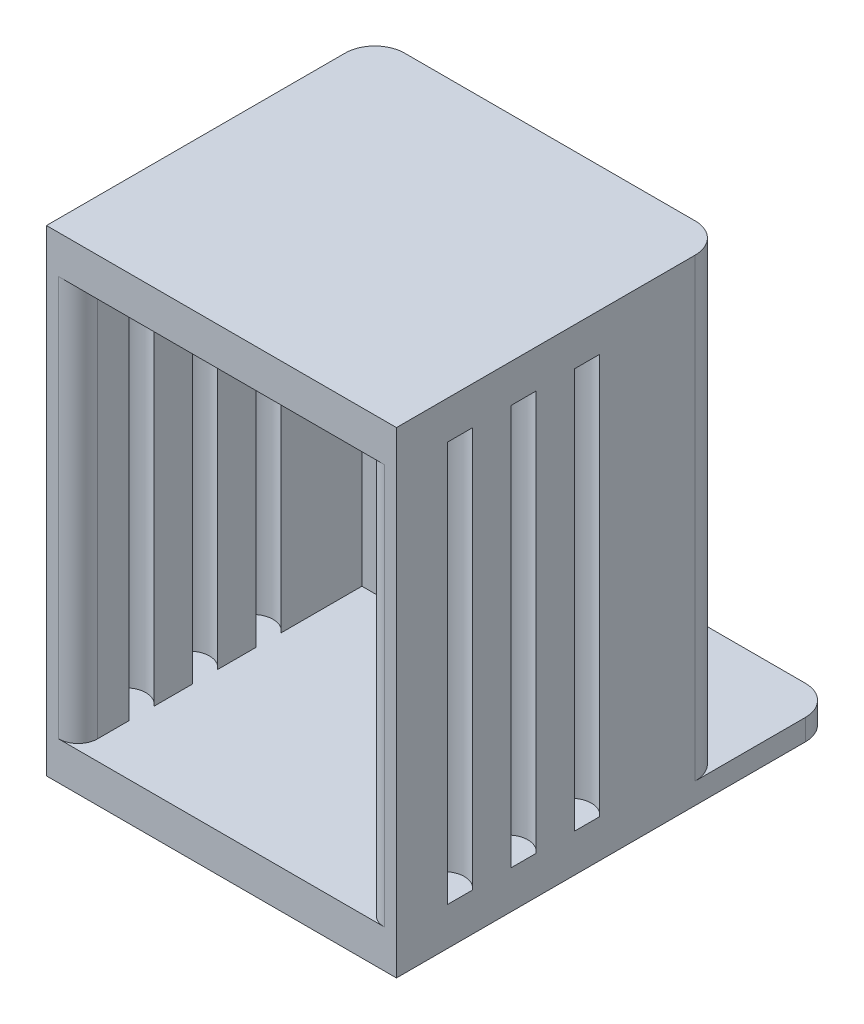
ISO-10303-21;
HEADER;
FILE_DESCRIPTION(('STEP AP214'),'2;1');
FILE_NAME('part.step','',(''),(''),'','','');
FILE_SCHEMA(('AUTOMOTIVE_DESIGN { 1 0 10303 214 1 1 1 1 }'));
ENDSEC;
DATA;
#1=APPLICATION_CONTEXT('core data for automotive mechanical design processes');
#2=APPLICATION_PROTOCOL_DEFINITION('international standard','automotive_design',2000,#1);
#3=PRODUCT_CONTEXT('',#1,'mechanical');
#4=PRODUCT('Part','Part','',(#3));
#5=PRODUCT_RELATED_PRODUCT_CATEGORY('part','',(#4));
#6=PRODUCT_DEFINITION_FORMATION('','',#4);
#7=PRODUCT_DEFINITION_CONTEXT('part definition',#1,'design');
#8=PRODUCT_DEFINITION('design','',#6,#7);
#9=PRODUCT_DEFINITION_SHAPE('','',#8);
#10=(LENGTH_UNIT() NAMED_UNIT(*) SI_UNIT(.MILLI.,.METRE.));
#11=(NAMED_UNIT(*) PLANE_ANGLE_UNIT() SI_UNIT($,.RADIAN.));
#12=(NAMED_UNIT(*) SI_UNIT($,.STERADIAN.) SOLID_ANGLE_UNIT());
#13=UNCERTAINTY_MEASURE_WITH_UNIT(LENGTH_MEASURE(1.E-05),#10,'distance_accuracy_value','');
#14=(GEOMETRIC_REPRESENTATION_CONTEXT(3) GLOBAL_UNCERTAINTY_ASSIGNED_CONTEXT((#13)) GLOBAL_UNIT_ASSIGNED_CONTEXT((#10,
#11,#12)) REPRESENTATION_CONTEXT('',''));
#15=CARTESIAN_POINT('',(0.,0.,0.));
#16=DIRECTION('',(0.,0.,1.));
#17=DIRECTION('',(1.,0.,0.));
#18=AXIS2_PLACEMENT_3D('',#15,#16,#17);
#19=CARTESIAN_POINT('',(-10.4902,28.575,0.));
#20=DIRECTION('',(1.,0.,0.));
#21=DIRECTION('',(0.,0.,-1.));
#22=AXIS2_PLACEMENT_3D('',#19,#20,#21);
#23=PLANE('',#22);
#24=DIRECTION('',(0.,0.,1.));
#25=VECTOR('',#24,1.);
#26=CARTESIAN_POINT('',(-10.4902,2.286,0.));
#27=LINE('',#26,#25);
#28=CARTESIAN_POINT('',(-10.4902,2.286,-8.36862702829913));
#29=VERTEX_POINT('',#28);
#30=CARTESIAN_POINT('',(-10.4902,2.286,-6.87137297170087));
#31=VERTEX_POINT('',#30);
#32=EDGE_CURVE('E339',#29,#31,#27,.T.);
#33=ORIENTED_EDGE('',*,*,#32,.F.);
#34=DIRECTION('',(0.,1.,0.));
#35=VECTOR('',#34,1.);
#36=CARTESIAN_POINT('',(-10.4902,2.286,-8.36862702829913));
#37=LINE('',#36,#35);
#38=CARTESIAN_POINT('',(-10.4902,26.289,-8.36862702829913));
#39=VERTEX_POINT('',#38);
#40=EDGE_CURVE('E334',#39,#29,#37,.F.);
#41=ORIENTED_EDGE('',*,*,#40,.F.);
#42=DIRECTION('',(0.,0.,1.));
#43=VECTOR('',#42,1.);
#44=CARTESIAN_POINT('',(-10.4902,26.289,0.));
#45=LINE('',#44,#43);
#46=CARTESIAN_POINT('',(-10.4902,26.289,-6.87137297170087));
#47=VERTEX_POINT('',#46);
#48=EDGE_CURVE('E336',#39,#47,#45,.T.);
#49=ORIENTED_EDGE('',*,*,#48,.T.);
#50=DIRECTION('',(0.,1.,0.));
#51=VECTOR('',#50,1.);
#52=CARTESIAN_POINT('',(-10.4902,2.286,-6.87137297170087));
#53=LINE('',#52,#51);
#54=EDGE_CURVE('E331',#31,#47,#53,.T.);
#55=ORIENTED_EDGE('',*,*,#54,.F.);
#56=EDGE_LOOP('',(#33,#41,#49,#55));
#57=FACE_BOUND('',#56,.T.);
#58=DIRECTION('',(0.,0.,-1.));
#59=VECTOR('',#58,1.);
#60=CARTESIAN_POINT('',(-10.4902,1.27,-26.289));
#61=LINE('',#60,#59);
#62=CARTESIAN_POINT('',(-10.4902,1.27,-17.907));
#63=VERTEX_POINT('',#62);
#64=CARTESIAN_POINT('',(-10.4902,1.27,-24.511));
#65=VERTEX_POINT('',#64);
#66=EDGE_CURVE('E443',#63,#65,#61,.T.);
#67=ORIENTED_EDGE('',*,*,#66,.T.);
#68=DIRECTION('',(0.,-1.,0.));
#69=VECTOR('',#68,1.);
#70=CARTESIAN_POINT('',(-10.4902,0.,-24.511));
#71=LINE('',#70,#69);
#72=CARTESIAN_POINT('',(-10.4902,0.,-24.511));
#73=VERTEX_POINT('',#72);
#74=EDGE_CURVE('E471',#65,#73,#71,.T.);
#75=ORIENTED_EDGE('',*,*,#74,.T.);
#76=DIRECTION('',(0.,0.,1.));
#77=VECTOR('',#76,1.);
#78=CARTESIAN_POINT('',(-10.4902,0.,0.));
#79=LINE('',#78,#77);
#80=CARTESIAN_POINT('',(-10.4902,0.,0.));
#81=VERTEX_POINT('',#80);
#82=EDGE_CURVE('E505',#73,#81,#79,.T.);
#83=ORIENTED_EDGE('',*,*,#82,.T.);
#84=DIRECTION('',(0.,-1.,0.));
#85=VECTOR('',#84,1.);
#86=CARTESIAN_POINT('',(-10.4902,28.575,0.));
#87=LINE('',#86,#85);
#88=CARTESIAN_POINT('',(-10.4902,28.575,0.));
#89=VERTEX_POINT('',#88);
#90=EDGE_CURVE('E492',#89,#81,#87,.T.);
#91=ORIENTED_EDGE('',*,*,#90,.F.);
#92=DIRECTION('',(0.,0.,1.));
#93=VECTOR('',#92,1.);
#94=CARTESIAN_POINT('',(-10.4902,28.575,0.));
#95=LINE('',#94,#93);
#96=CARTESIAN_POINT('',(-10.4902,28.575,-17.907));
#97=VERTEX_POINT('',#96);
#98=EDGE_CURVE('E502',#97,#89,#95,.T.);
#99=ORIENTED_EDGE('',*,*,#98,.F.);
#100=DIRECTION('',(0.,-1.,0.));
#101=VECTOR('',#100,1.);
#102=CARTESIAN_POINT('',(-10.4902,28.575,-17.907));
#103=LINE('',#102,#101);
#104=EDGE_CURVE('E453',#97,#63,#103,.T.);
#105=ORIENTED_EDGE('',*,*,#104,.T.);
#106=EDGE_LOOP('',(#67,#75,#83,#91,#99,#105));
#107=FACE_BOUND('',#106,.T.);
#108=DIRECTION('',(0.,0.,1.));
#109=VECTOR('',#108,1.);
#110=CARTESIAN_POINT('',(-10.4902,2.286,0.));
#111=LINE('',#110,#109);
#112=CARTESIAN_POINT('',(-10.4902,2.286,-4.55862702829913));
#113=VERTEX_POINT('',#112);
#114=CARTESIAN_POINT('',(-10.4902,2.286,-3.06137297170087));
#115=VERTEX_POINT('',#114);
#116=EDGE_CURVE('E361',#113,#115,#111,.T.);
#117=ORIENTED_EDGE('',*,*,#116,.F.);
#118=DIRECTION('',(0.,1.,0.));
#119=VECTOR('',#118,1.);
#120=CARTESIAN_POINT('',(-10.4902,2.286,-4.55862702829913));
#121=LINE('',#120,#119);
#122=CARTESIAN_POINT('',(-10.4902,26.289,-4.55862702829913));
#123=VERTEX_POINT('',#122);
#124=EDGE_CURVE('E356',#123,#113,#121,.F.);
#125=ORIENTED_EDGE('',*,*,#124,.F.);
#126=DIRECTION('',(0.,0.,1.));
#127=VECTOR('',#126,1.);
#128=CARTESIAN_POINT('',(-10.4902,26.289,0.));
#129=LINE('',#128,#127);
#130=CARTESIAN_POINT('',(-10.4902,26.289,-3.06137297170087));
#131=VERTEX_POINT('',#130);
#132=EDGE_CURVE('E358',#123,#131,#129,.T.);
#133=ORIENTED_EDGE('',*,*,#132,.T.);
#134=DIRECTION('',(0.,1.,0.));
#135=VECTOR('',#134,1.);
#136=CARTESIAN_POINT('',(-10.4902,2.286,-3.06137297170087));
#137=LINE('',#136,#135);
#138=EDGE_CURVE('E353',#115,#131,#137,.T.);
#139=ORIENTED_EDGE('',*,*,#138,.F.);
#140=EDGE_LOOP('',(#117,#125,#133,#139));
#141=FACE_BOUND('',#140,.T.);
#142=DIRECTION('',(0.,0.,1.));
#143=VECTOR('',#142,1.);
#144=CARTESIAN_POINT('',(-10.4902,2.286,0.));
#145=LINE('',#144,#143);
#146=CARTESIAN_POINT('',(-10.4902,2.286,-12.1786270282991));
#147=VERTEX_POINT('',#146);
#148=CARTESIAN_POINT('',(-10.4902,2.286,-10.6813729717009));
#149=VERTEX_POINT('',#148);
#150=EDGE_CURVE('E290',#147,#149,#145,.T.);
#151=ORIENTED_EDGE('',*,*,#150,.F.);
#152=DIRECTION('',(0.,1.,0.));
#153=VECTOR('',#152,1.);
#154=CARTESIAN_POINT('',(-10.4902,2.286,-12.1786270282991));
#155=LINE('',#154,#153);
#156=CARTESIAN_POINT('',(-10.4902,26.289,-12.1786270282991));
#157=VERTEX_POINT('',#156);
#158=EDGE_CURVE('E312',#157,#147,#155,.F.);
#159=ORIENTED_EDGE('',*,*,#158,.F.);
#160=DIRECTION('',(0.,0.,1.));
#161=VECTOR('',#160,1.);
#162=CARTESIAN_POINT('',(-10.4902,26.289,0.));
#163=LINE('',#162,#161);
#164=CARTESIAN_POINT('',(-10.4902,26.289,-10.6813729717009));
#165=VERTEX_POINT('',#164);
#166=EDGE_CURVE('E301',#157,#165,#163,.T.);
#167=ORIENTED_EDGE('',*,*,#166,.T.);
#168=DIRECTION('',(0.,1.,0.));
#169=VECTOR('',#168,1.);
#170=CARTESIAN_POINT('',(-10.4902,2.286,-10.6813729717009));
#171=LINE('',#170,#169);
#172=EDGE_CURVE('E306',#149,#165,#171,.T.);
#173=ORIENTED_EDGE('',*,*,#172,.F.);
#174=EDGE_LOOP('',(#151,#159,#167,#173));
#175=FACE_BOUND('',#174,.T.);
#176=ADVANCED_FACE('F32',(#57,#107,#141,#175),#23,.F.);
#177=CARTESIAN_POINT('',(-8.5979,2.286,-17.018));
#178=DIRECTION('',(-1.,0.,0.));
#179=DIRECTION('',(0.,0.,1.));
#180=AXIS2_PLACEMENT_3D('',#177,#178,#179);
#181=PLANE('',#180);
#182=DIRECTION('',(0.,1.,0.));
#183=VECTOR('',#182,1.);
#184=CARTESIAN_POINT('',(-8.5979,2.286,-10.6813729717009));
#185=LINE('',#184,#183);
#186=CARTESIAN_POINT('',(-8.5979,26.289,-10.6813729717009));
#187=VERTEX_POINT('',#186);
#188=CARTESIAN_POINT('',(-8.5979,2.286,-10.6813729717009));
#189=VERTEX_POINT('',#188);
#190=EDGE_CURVE('E309',#187,#189,#185,.F.);
#191=ORIENTED_EDGE('',*,*,#190,.F.);
#192=DIRECTION('',(0.,0.,1.));
#193=VECTOR('',#192,1.);
#194=CARTESIAN_POINT('',(-8.5979,26.289,-17.018));
#195=LINE('',#194,#193);
#196=CARTESIAN_POINT('',(-8.5979,26.289,-8.36862702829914));
#197=VERTEX_POINT('',#196);
#198=EDGE_CURVE('E533',#187,#197,#195,.T.);
#199=ORIENTED_EDGE('',*,*,#198,.T.);
#200=DIRECTION('',(0.,1.,0.));
#201=VECTOR('',#200,1.);
#202=CARTESIAN_POINT('',(-8.5979,2.286,-8.36862702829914));
#203=LINE('',#202,#201);
#204=CARTESIAN_POINT('',(-8.5979,2.286,-8.36862702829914));
#205=VERTEX_POINT('',#204);
#206=EDGE_CURVE('E326',#205,#197,#203,.T.);
#207=ORIENTED_EDGE('',*,*,#206,.F.);
#208=DIRECTION('',(0.,0.,1.));
#209=VECTOR('',#208,1.);
#210=CARTESIAN_POINT('',(-8.5979,2.286,-17.018));
#211=LINE('',#210,#209);
#212=EDGE_CURVE('E519',#189,#205,#211,.T.);
#213=ORIENTED_EDGE('',*,*,#212,.F.);
#214=EDGE_LOOP('',(#191,#199,#207,#213));
#215=FACE_BOUND('',#214,.T.);
#216=ADVANCED_FACE('F570',(#215),#181,.F.);
#217=DIRECTION('',(0.,1.,0.));
#218=VECTOR('',#217,1.);
#219=CARTESIAN_POINT('',(-8.5979,2.286,-12.1786270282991));
#220=LINE('',#219,#218);
#221=CARTESIAN_POINT('',(-8.5979,2.286,-12.1786270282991));
#222=VERTEX_POINT('',#221);
#223=CARTESIAN_POINT('',(-8.5979,26.289,-12.1786270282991));
#224=VERTEX_POINT('',#223);
#225=EDGE_CURVE('E315',#222,#224,#220,.T.);
#226=ORIENTED_EDGE('',*,*,#225,.F.);
#227=CARTESIAN_POINT('',(-8.5979,2.286,-17.018));
#228=VERTEX_POINT('',#227);
#229=EDGE_CURVE('E516',#228,#222,#211,.T.);
#230=ORIENTED_EDGE('',*,*,#229,.F.);
#231=DIRECTION('',(0.,-1.,0.));
#232=VECTOR('',#231,1.);
#233=CARTESIAN_POINT('',(-8.5979,2.286,-17.018));
#234=LINE('',#233,#232);
#235=CARTESIAN_POINT('',(-8.5979,26.289,-17.018));
#236=VERTEX_POINT('',#235);
#237=EDGE_CURVE('E536',#236,#228,#234,.T.);
#238=ORIENTED_EDGE('',*,*,#237,.F.);
#239=EDGE_CURVE('E507',#236,#224,#195,.T.);
#240=ORIENTED_EDGE('',*,*,#239,.T.);
#241=EDGE_LOOP('',(#226,#230,#238,#240));
#242=FACE_BOUND('',#241,.T.);
#243=ADVANCED_FACE('F554',(#242),#181,.F.);
#244=DIRECTION('',(0.,1.,0.));
#245=VECTOR('',#244,1.);
#246=CARTESIAN_POINT('',(-8.5979,2.286,-6.87137297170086));
#247=LINE('',#246,#245);
#248=CARTESIAN_POINT('',(-8.5979,26.289,-6.87137297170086));
#249=VERTEX_POINT('',#248);
#250=CARTESIAN_POINT('',(-8.5979,2.286,-6.87137297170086));
#251=VERTEX_POINT('',#250);
#252=EDGE_CURVE('E329',#249,#251,#247,.F.);
#253=ORIENTED_EDGE('',*,*,#252,.F.);
#254=CARTESIAN_POINT('',(-8.5979,26.289,-4.55862702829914));
#255=VERTEX_POINT('',#254);
#256=EDGE_CURVE('E1031',#249,#255,#195,.T.);
#257=ORIENTED_EDGE('',*,*,#256,.T.);
#258=DIRECTION('',(0.,1.,0.));
#259=VECTOR('',#258,1.);
#260=CARTESIAN_POINT('',(-8.5979,2.286,-4.55862702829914));
#261=LINE('',#260,#259);
#262=CARTESIAN_POINT('',(-8.5979,2.286,-4.55862702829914));
#263=VERTEX_POINT('',#262);
#264=EDGE_CURVE('E348',#263,#255,#261,.T.);
#265=ORIENTED_EDGE('',*,*,#264,.F.);
#266=EDGE_CURVE('E574',#251,#263,#211,.T.);
#267=ORIENTED_EDGE('',*,*,#266,.F.);
#268=EDGE_LOOP('',(#253,#257,#265,#267));
#269=FACE_BOUND('',#268,.T.);
#270=ADVANCED_FACE('F717',(#269),#181,.F.);
#271=CARTESIAN_POINT('',(-8.5979,26.289,-3.06137297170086));
#272=VERTEX_POINT('',#271);
#273=CARTESIAN_POINT('',(-8.5979,26.289,-1.1684));
#274=VERTEX_POINT('',#273);
#275=EDGE_CURVE('E529',#272,#274,#195,.T.);
#276=ORIENTED_EDGE('',*,*,#275,.T.);
#277=DIRECTION('',(0.,-1.,0.));
#278=VECTOR('',#277,1.);
#279=CARTESIAN_POINT('',(-8.5979,2.286,-1.1684));
#280=LINE('',#279,#278);
#281=CARTESIAN_POINT('',(-8.5979,2.286,-1.1684));
#282=VERTEX_POINT('',#281);
#283=EDGE_CURVE('E585',#274,#282,#280,.T.);
#284=ORIENTED_EDGE('',*,*,#283,.T.);
#285=CARTESIAN_POINT('',(-8.5979,2.286,-3.06137297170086));
#286=VERTEX_POINT('',#285);
#287=EDGE_CURVE('E520',#286,#282,#211,.T.);
#288=ORIENTED_EDGE('',*,*,#287,.F.);
#289=DIRECTION('',(0.,1.,0.));
#290=VECTOR('',#289,1.);
#291=CARTESIAN_POINT('',(-8.5979,2.286,-3.06137297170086));
#292=LINE('',#291,#290);
#293=EDGE_CURVE('E351',#272,#286,#292,.F.);
#294=ORIENTED_EDGE('',*,*,#293,.F.);
#295=EDGE_LOOP('',(#276,#284,#288,#294));
#296=FACE_BOUND('',#295,.T.);
#297=ADVANCED_FACE('F584',(#296),#181,.F.);
#298=CARTESIAN_POINT('',(10.4902,28.575,0.));
#299=DIRECTION('',(-1.,0.,0.));
#300=DIRECTION('',(0.,0.,1.));
#301=AXIS2_PLACEMENT_3D('',#298,#299,#300);
#302=PLANE('',#301);
#303=DIRECTION('',(0.,0.,-1.));
#304=VECTOR('',#303,1.);
#305=CARTESIAN_POINT('',(10.4902,2.286,0.));
#306=LINE('',#305,#304);
#307=CARTESIAN_POINT('',(10.4902,2.286,-6.87137297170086));
#308=VERTEX_POINT('',#307);
#309=CARTESIAN_POINT('',(10.4902,2.286,-8.36862702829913));
#310=VERTEX_POINT('',#309);
#311=EDGE_CURVE('E411',#308,#310,#306,.T.);
#312=ORIENTED_EDGE('',*,*,#311,.F.);
#313=DIRECTION('',(0.,1.,0.));
#314=VECTOR('',#313,1.);
#315=CARTESIAN_POINT('',(10.4902,2.286,-6.87137297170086));
#316=LINE('',#315,#314);
#317=CARTESIAN_POINT('',(10.4902,26.289,-6.87137297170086));
#318=VERTEX_POINT('',#317);
#319=EDGE_CURVE('E405',#308,#318,#316,.T.);
#320=ORIENTED_EDGE('',*,*,#319,.T.);
#321=DIRECTION('',(0.,0.,-1.));
#322=VECTOR('',#321,1.);
#323=CARTESIAN_POINT('',(10.4902,26.289,0.));
#324=LINE('',#323,#322);
#325=CARTESIAN_POINT('',(10.4902,26.289,-8.36862702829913));
#326=VERTEX_POINT('',#325);
#327=EDGE_CURVE('E408',#318,#326,#324,.T.);
#328=ORIENTED_EDGE('',*,*,#327,.T.);
#329=DIRECTION('',(0.,1.,0.));
#330=VECTOR('',#329,1.);
#331=CARTESIAN_POINT('',(10.4902,2.286,-8.36862702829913));
#332=LINE('',#331,#330);
#333=EDGE_CURVE('E402',#326,#310,#332,.F.);
#334=ORIENTED_EDGE('',*,*,#333,.T.);
#335=EDGE_LOOP('',(#312,#320,#328,#334));
#336=FACE_BOUND('',#335,.T.);
#337=DIRECTION('',(0.,0.,-1.));
#338=VECTOR('',#337,1.);
#339=CARTESIAN_POINT('',(10.4902,0.,0.));
#340=LINE('',#339,#338);
#341=CARTESIAN_POINT('',(10.4902,0.,0.));
#342=VERTEX_POINT('',#341);
#343=CARTESIAN_POINT('',(10.4902,0.,-24.511));
#344=VERTEX_POINT('',#343);
#345=EDGE_CURVE('E499',#342,#344,#340,.T.);
#346=ORIENTED_EDGE('',*,*,#345,.T.);
#347=DIRECTION('',(0.,-1.,0.));
#348=VECTOR('',#347,1.);
#349=CARTESIAN_POINT('',(10.4902,1.27,-24.511));
#350=LINE('',#349,#348);
#351=CARTESIAN_POINT('',(10.4902,1.27,-24.511));
#352=VERTEX_POINT('',#351);
#353=EDGE_CURVE('E612',#344,#352,#350,.F.);
#354=ORIENTED_EDGE('',*,*,#353,.T.);
#355=DIRECTION('',(0.,0.,1.));
#356=VECTOR('',#355,1.);
#357=CARTESIAN_POINT('',(10.4902,1.27,-26.289));
#358=LINE('',#357,#356);
#359=CARTESIAN_POINT('',(10.4902,1.27,-17.907));
#360=VERTEX_POINT('',#359);
#361=EDGE_CURVE('E442',#352,#360,#358,.T.);
#362=ORIENTED_EDGE('',*,*,#361,.T.);
#363=DIRECTION('',(0.,-1.,0.));
#364=VECTOR('',#363,1.);
#365=CARTESIAN_POINT('',(10.4902,28.575,-17.907));
#366=LINE('',#365,#364);
#367=CARTESIAN_POINT('',(10.4902,28.575,-17.907));
#368=VERTEX_POINT('',#367);
#369=EDGE_CURVE('E464',#360,#368,#366,.F.);
#370=ORIENTED_EDGE('',*,*,#369,.T.);
#371=DIRECTION('',(0.,0.,-1.));
#372=VECTOR('',#371,1.);
#373=CARTESIAN_POINT('',(10.4902,28.575,0.));
#374=LINE('',#373,#372);
#375=CARTESIAN_POINT('',(10.4902,28.575,0.));
#376=VERTEX_POINT('',#375);
#377=EDGE_CURVE('E510',#376,#368,#374,.T.);
#378=ORIENTED_EDGE('',*,*,#377,.F.);
#379=DIRECTION('',(0.,-1.,0.));
#380=VECTOR('',#379,1.);
#381=CARTESIAN_POINT('',(10.4902,28.575,0.));
#382=LINE('',#381,#380);
#383=EDGE_CURVE('E495',#376,#342,#382,.T.);
#384=ORIENTED_EDGE('',*,*,#383,.T.);
#385=EDGE_LOOP('',(#346,#354,#362,#370,#378,#384));
#386=FACE_BOUND('',#385,.T.);
#387=DIRECTION('',(0.,0.,-1.));
#388=VECTOR('',#387,1.);
#389=CARTESIAN_POINT('',(10.4902,2.286,0.));
#390=LINE('',#389,#388);
#391=CARTESIAN_POINT('',(10.4902,2.286,-3.06137297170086));
#392=VERTEX_POINT('',#391);
#393=CARTESIAN_POINT('',(10.4902,2.286,-4.55862702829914));
#394=VERTEX_POINT('',#393);
#395=EDGE_CURVE('E436',#392,#394,#390,.T.);
#396=ORIENTED_EDGE('',*,*,#395,.F.);
#397=DIRECTION('',(0.,1.,0.));
#398=VECTOR('',#397,1.);
#399=CARTESIAN_POINT('',(10.4902,2.286,-3.06137297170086));
#400=LINE('',#399,#398);
#401=CARTESIAN_POINT('',(10.4902,26.289,-3.06137297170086));
#402=VERTEX_POINT('',#401);
#403=EDGE_CURVE('E430',#392,#402,#400,.T.);
#404=ORIENTED_EDGE('',*,*,#403,.T.);
#405=DIRECTION('',(0.,0.,-1.));
#406=VECTOR('',#405,1.);
#407=CARTESIAN_POINT('',(10.4902,26.289,0.));
#408=LINE('',#407,#406);
#409=CARTESIAN_POINT('',(10.4902,26.289,-4.55862702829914));
#410=VERTEX_POINT('',#409);
#411=EDGE_CURVE('E433',#402,#410,#408,.T.);
#412=ORIENTED_EDGE('',*,*,#411,.T.);
#413=DIRECTION('',(0.,1.,0.));
#414=VECTOR('',#413,1.);
#415=CARTESIAN_POINT('',(10.4902,2.286,-4.55862702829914));
#416=LINE('',#415,#414);
#417=EDGE_CURVE('E427',#410,#394,#416,.F.);
#418=ORIENTED_EDGE('',*,*,#417,.T.);
#419=EDGE_LOOP('',(#396,#404,#412,#418));
#420=FACE_BOUND('',#419,.T.);
#421=DIRECTION('',(0.,0.,-1.));
#422=VECTOR('',#421,1.);
#423=CARTESIAN_POINT('',(10.4902,2.286,0.));
#424=LINE('',#423,#422);
#425=CARTESIAN_POINT('',(10.4902,2.286,-10.6813729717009));
#426=VERTEX_POINT('',#425);
#427=CARTESIAN_POINT('',(10.4902,2.286,-12.1786270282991));
#428=VERTEX_POINT('',#427);
#429=EDGE_CURVE('E386',#426,#428,#424,.T.);
#430=ORIENTED_EDGE('',*,*,#429,.F.);
#431=DIRECTION('',(0.,1.,0.));
#432=VECTOR('',#431,1.);
#433=CARTESIAN_POINT('',(10.4902,2.286,-10.6813729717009));
#434=LINE('',#433,#432);
#435=CARTESIAN_POINT('',(10.4902,26.289,-10.6813729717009));
#436=VERTEX_POINT('',#435);
#437=EDGE_CURVE('E380',#426,#436,#434,.T.);
#438=ORIENTED_EDGE('',*,*,#437,.T.);
#439=DIRECTION('',(0.,0.,-1.));
#440=VECTOR('',#439,1.);
#441=CARTESIAN_POINT('',(10.4902,26.289,0.));
#442=LINE('',#441,#440);
#443=CARTESIAN_POINT('',(10.4902,26.289,-12.1786270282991));
#444=VERTEX_POINT('',#443);
#445=EDGE_CURVE('E383',#436,#444,#442,.T.);
#446=ORIENTED_EDGE('',*,*,#445,.T.);
#447=DIRECTION('',(0.,1.,0.));
#448=VECTOR('',#447,1.);
#449=CARTESIAN_POINT('',(10.4902,2.286,-12.1786270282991));
#450=LINE('',#449,#448);
#451=EDGE_CURVE('E377',#444,#428,#450,.F.);
#452=ORIENTED_EDGE('',*,*,#451,.T.);
#453=EDGE_LOOP('',(#430,#438,#446,#452));
#454=FACE_BOUND('',#453,.T.);
#455=ADVANCED_FACE('F638',(#336,#386,#420,#454),#302,.F.);
#456=CARTESIAN_POINT('',(8.5979,2.286,-17.018));
#457=DIRECTION('',(1.,0.,0.));
#458=DIRECTION('',(0.,0.,-1.));
#459=AXIS2_PLACEMENT_3D('',#456,#457,#458);
#460=PLANE('',#459);
#461=DIRECTION('',(0.,0.,1.));
#462=VECTOR('',#461,1.);
#463=CARTESIAN_POINT('',(8.5979,2.286,-17.018));
#464=LINE('',#463,#462);
#465=CARTESIAN_POINT('',(8.5979,2.286,-17.018));
#466=VERTEX_POINT('',#465);
#467=CARTESIAN_POINT('',(8.5979,2.286,-12.1786270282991));
#468=VERTEX_POINT('',#467);
#469=EDGE_CURVE('E521',#466,#468,#464,.T.);
#470=ORIENTED_EDGE('',*,*,#469,.T.);
#471=DIRECTION('',(0.,1.,0.));
#472=VECTOR('',#471,1.);
#473=CARTESIAN_POINT('',(8.5979,2.286,-12.1786270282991));
#474=LINE('',#473,#472);
#475=CARTESIAN_POINT('',(8.5979,26.289,-12.1786270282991));
#476=VERTEX_POINT('',#475);
#477=EDGE_CURVE('E374',#468,#476,#474,.T.);
#478=ORIENTED_EDGE('',*,*,#477,.T.);
#479=DIRECTION('',(0.,0.,1.));
#480=VECTOR('',#479,1.);
#481=CARTESIAN_POINT('',(8.5979,26.289,-17.018));
#482=LINE('',#481,#480);
#483=CARTESIAN_POINT('',(8.5979,26.289,-17.018));
#484=VERTEX_POINT('',#483);
#485=EDGE_CURVE('E526',#484,#476,#482,.T.);
#486=ORIENTED_EDGE('',*,*,#485,.F.);
#487=DIRECTION('',(0.,1.,0.));
#488=VECTOR('',#487,1.);
#489=CARTESIAN_POINT('',(8.5979,2.286,-17.018));
#490=LINE('',#489,#488);
#491=EDGE_CURVE('E541',#466,#484,#490,.T.);
#492=ORIENTED_EDGE('',*,*,#491,.F.);
#493=EDGE_LOOP('',(#470,#478,#486,#492));
#494=FACE_BOUND('',#493,.T.);
#495=ADVANCED_FACE('F560',(#494),#460,.F.);
#496=CARTESIAN_POINT('',(8.5979,26.289,-10.6813729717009));
#497=VERTEX_POINT('',#496);
#498=CARTESIAN_POINT('',(8.5979,26.289,-8.36862702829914));
#499=VERTEX_POINT('',#498);
#500=EDGE_CURVE('E530',#497,#499,#482,.T.);
#501=ORIENTED_EDGE('',*,*,#500,.F.);
#502=DIRECTION('',(0.,1.,0.));
#503=VECTOR('',#502,1.);
#504=CARTESIAN_POINT('',(8.5979,2.286,-10.6813729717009));
#505=LINE('',#504,#503);
#506=CARTESIAN_POINT('',(8.5979,2.286,-10.6813729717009));
#507=VERTEX_POINT('',#506);
#508=EDGE_CURVE('E371',#497,#507,#505,.F.);
#509=ORIENTED_EDGE('',*,*,#508,.T.);
#510=CARTESIAN_POINT('',(8.5979,2.286,-8.36862702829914));
#511=VERTEX_POINT('',#510);
#512=EDGE_CURVE('E525',#507,#511,#464,.T.);
#513=ORIENTED_EDGE('',*,*,#512,.T.);
#514=DIRECTION('',(0.,1.,0.));
#515=VECTOR('',#514,1.);
#516=CARTESIAN_POINT('',(8.5979,2.286,-8.36862702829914));
#517=LINE('',#516,#515);
#518=EDGE_CURVE('E399',#511,#499,#517,.T.);
#519=ORIENTED_EDGE('',*,*,#518,.T.);
#520=EDGE_LOOP('',(#501,#509,#513,#519));
#521=FACE_BOUND('',#520,.T.);
#522=ADVANCED_FACE('F715',(#521),#460,.F.);
#523=CARTESIAN_POINT('',(8.5979,26.289,-6.87137297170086));
#524=VERTEX_POINT('',#523);
#525=CARTESIAN_POINT('',(8.5979,26.289,-4.55862702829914));
#526=VERTEX_POINT('',#525);
#527=EDGE_CURVE('E742',#524,#526,#482,.T.);
#528=ORIENTED_EDGE('',*,*,#527,.F.);
#529=DIRECTION('',(0.,1.,0.));
#530=VECTOR('',#529,1.);
#531=CARTESIAN_POINT('',(8.5979,2.286,-6.87137297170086));
#532=LINE('',#531,#530);
#533=CARTESIAN_POINT('',(8.5979,2.286,-6.87137297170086));
#534=VERTEX_POINT('',#533);
#535=EDGE_CURVE('E396',#524,#534,#532,.F.);
#536=ORIENTED_EDGE('',*,*,#535,.T.);
#537=CARTESIAN_POINT('',(8.5979,2.286,-4.55862702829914));
#538=VERTEX_POINT('',#537);
#539=EDGE_CURVE('E610',#534,#538,#464,.T.);
#540=ORIENTED_EDGE('',*,*,#539,.T.);
#541=DIRECTION('',(0.,1.,0.));
#542=VECTOR('',#541,1.);
#543=CARTESIAN_POINT('',(8.5979,2.286,-4.55862702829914));
#544=LINE('',#543,#542);
#545=EDGE_CURVE('E424',#538,#526,#544,.T.);
#546=ORIENTED_EDGE('',*,*,#545,.T.);
#547=EDGE_LOOP('',(#528,#536,#540,#546));
#548=FACE_BOUND('',#547,.T.);
#549=ADVANCED_FACE('F706',(#548),#460,.F.);
#550=CARTESIAN_POINT('',(-10.4902,28.575,0.));
#551=DIRECTION('',(0.,0.,-1.));
#552=DIRECTION('',(-1.,0.,0.));
#553=AXIS2_PLACEMENT_3D('',#550,#551,#552);
#554=PLANE('',#553);
#555=DIRECTION('',(-1.,0.,0.));
#556=VECTOR('',#555,1.);
#557=CARTESIAN_POINT('',(-8.5979,26.289,0.));
#558=LINE('',#557,#556);
#559=CARTESIAN_POINT('',(9.7663,26.289,0.));
#560=VERTEX_POINT('',#559);
#561=CARTESIAN_POINT('',(-9.7663,26.289,0.));
#562=VERTEX_POINT('',#561);
#563=EDGE_CURVE('E534',#560,#562,#558,.T.);
#564=ORIENTED_EDGE('',*,*,#563,.F.);
#565=DIRECTION('',(0.,1.,0.));
#566=VECTOR('',#565,1.);
#567=CARTESIAN_POINT('',(9.7663,28.575,0.));
#568=LINE('',#567,#566);
#569=CARTESIAN_POINT('',(9.7663,2.286,0.));
#570=VERTEX_POINT('',#569);
#571=EDGE_CURVE('E587',#560,#570,#568,.F.);
#572=ORIENTED_EDGE('',*,*,#571,.T.);
#573=DIRECTION('',(1.,0.,0.));
#574=VECTOR('',#573,1.);
#575=CARTESIAN_POINT('',(-8.5979,2.286,0.));
#576=LINE('',#575,#574);
#577=CARTESIAN_POINT('',(-9.7663,2.286,0.));
#578=VERTEX_POINT('',#577);
#579=EDGE_CURVE('E452',#578,#570,#576,.T.);
#580=ORIENTED_EDGE('',*,*,#579,.F.);
#581=DIRECTION('',(0.,-1.,0.));
#582=VECTOR('',#581,1.);
#583=CARTESIAN_POINT('',(-9.7663,28.575,0.));
#584=LINE('',#583,#582);
#585=EDGE_CURVE('E593',#578,#562,#584,.F.);
#586=ORIENTED_EDGE('',*,*,#585,.T.);
#587=EDGE_LOOP('',(#564,#572,#580,#586));
#588=FACE_BOUND('',#587,.T.);
#589=DIRECTION('',(1.,0.,0.));
#590=VECTOR('',#589,1.);
#591=CARTESIAN_POINT('',(-10.4902,0.,0.));
#592=LINE('',#591,#590);
#593=EDGE_CURVE('E503',#81,#342,#592,.T.);
#594=ORIENTED_EDGE('',*,*,#593,.T.);
#595=ORIENTED_EDGE('',*,*,#383,.F.);
#596=DIRECTION('',(1.,0.,0.));
#597=VECTOR('',#596,1.);
#598=CARTESIAN_POINT('',(-10.4902,28.575,0.));
#599=LINE('',#598,#597);
#600=EDGE_CURVE('E513',#89,#376,#599,.T.);
#601=ORIENTED_EDGE('',*,*,#600,.F.);
#602=ORIENTED_EDGE('',*,*,#90,.T.);
#603=EDGE_LOOP('',(#594,#595,#601,#602));
#604=FACE_BOUND('',#603,.T.);
#605=ADVANCED_FACE('F644',(#588,#604),#554,.F.);
#606=CARTESIAN_POINT('',(-10.4902,28.575,-19.685));
#607=DIRECTION('',(0.,0.,1.));
#608=DIRECTION('',(1.,0.,0.));
#609=AXIS2_PLACEMENT_3D('',#606,#607,#608);
#610=PLANE('',#609);
#611=DIRECTION('',(-1.,0.,0.));
#612=VECTOR('',#611,1.);
#613=CARTESIAN_POINT('',(-10.4902,1.27,-19.685));
#614=LINE('',#613,#612);
#615=CARTESIAN_POINT('',(8.7122,1.27,-19.685));
#616=VERTEX_POINT('',#615);
#617=CARTESIAN_POINT('',(-8.7122,1.27,-19.685));
#618=VERTEX_POINT('',#617);
#619=EDGE_CURVE('E448',#616,#618,#614,.T.);
#620=ORIENTED_EDGE('',*,*,#619,.T.);
#621=DIRECTION('',(0.,-1.,0.));
#622=VECTOR('',#621,1.);
#623=CARTESIAN_POINT('',(-8.7122,28.575,-19.685));
#624=LINE('',#623,#622);
#625=CARTESIAN_POINT('',(-8.7122,28.575,-19.685));
#626=VERTEX_POINT('',#625);
#627=EDGE_CURVE('E458',#618,#626,#624,.F.);
#628=ORIENTED_EDGE('',*,*,#627,.T.);
#629=DIRECTION('',(-1.,0.,0.));
#630=VECTOR('',#629,1.);
#631=CARTESIAN_POINT('',(-10.4902,28.575,-19.685));
#632=LINE('',#631,#630);
#633=CARTESIAN_POINT('',(8.7122,28.575,-19.685));
#634=VERTEX_POINT('',#633);
#635=EDGE_CURVE('E498',#634,#626,#632,.T.);
#636=ORIENTED_EDGE('',*,*,#635,.F.);
#637=DIRECTION('',(0.,-1.,0.));
#638=VECTOR('',#637,1.);
#639=CARTESIAN_POINT('',(8.7122,28.575,-19.685));
#640=LINE('',#639,#638);
#641=EDGE_CURVE('E455',#634,#616,#640,.T.);
#642=ORIENTED_EDGE('',*,*,#641,.T.);
#643=EDGE_LOOP('',(#620,#628,#636,#642));
#644=FACE_BOUND('',#643,.T.);
#645=ADVANCED_FACE('F694',(#644),#610,.F.);
#646=CARTESIAN_POINT('',(-10.4902,28.575,-19.685));
#647=DIRECTION('',(0.,-1.,0.));
#648=DIRECTION('',(0.,0.,-1.));
#649=AXIS2_PLACEMENT_3D('',#646,#647,#648);
#650=PLANE('',#649);
#651=ORIENTED_EDGE('',*,*,#635,.T.);
#652=CARTESIAN_POINT('',(-8.7122,28.575,-17.907));
#653=DIRECTION('',(0.,-1.,0.));
#654=DIRECTION('',(0.,0.,-1.));
#655=AXIS2_PLACEMENT_3D('',#652,#653,#654);
#656=CIRCLE('',#655,1.778);
#657=EDGE_CURVE('E462',#626,#97,#656,.F.);
#658=ORIENTED_EDGE('',*,*,#657,.T.);
#659=ORIENTED_EDGE('',*,*,#98,.T.);
#660=ORIENTED_EDGE('',*,*,#600,.T.);
#661=ORIENTED_EDGE('',*,*,#377,.T.);
#662=CARTESIAN_POINT('',(8.7122,28.575,-17.907));
#663=DIRECTION('',(0.,-1.,0.));
#664=DIRECTION('',(0.,0.,-1.));
#665=AXIS2_PLACEMENT_3D('',#662,#663,#664);
#666=CIRCLE('',#665,1.778);
#667=EDGE_CURVE('E460',#368,#634,#666,.F.);
#668=ORIENTED_EDGE('',*,*,#667,.T.);
#669=EDGE_LOOP('',(#651,#658,#659,#660,#661,#668));
#670=FACE_BOUND('',#669,.T.);
#671=ADVANCED_FACE('F691',(#670),#650,.F.);
#672=CARTESIAN_POINT('',(-10.4902,0.,-19.685));
#673=DIRECTION('',(0.,-1.,0.));
#674=DIRECTION('',(0.,0.,-1.));
#675=AXIS2_PLACEMENT_3D('',#672,#673,#674);
#676=PLANE('',#675);
#677=ORIENTED_EDGE('',*,*,#82,.F.);
#678=CARTESIAN_POINT('',(-8.7122,0.,-24.511));
#679=DIRECTION('',(0.,-1.,0.));
#680=DIRECTION('',(0.,0.,-1.));
#681=AXIS2_PLACEMENT_3D('',#678,#679,#680);
#682=CIRCLE('',#681,1.778);
#683=CARTESIAN_POINT('',(-8.7122,0.,-26.289));
#684=VERTEX_POINT('',#683);
#685=EDGE_CURVE('E476',#73,#684,#682,.T.);
#686=ORIENTED_EDGE('',*,*,#685,.T.);
#687=DIRECTION('',(1.,0.,0.));
#688=VECTOR('',#687,1.);
#689=CARTESIAN_POINT('',(-10.4902,0.,-26.289));
#690=LINE('',#689,#688);
#691=CARTESIAN_POINT('',(8.7122,0.,-26.289));
#692=VERTEX_POINT('',#691);
#693=EDGE_CURVE('E438',#684,#692,#690,.T.);
#694=ORIENTED_EDGE('',*,*,#693,.T.);
#695=CARTESIAN_POINT('',(8.7122,0.,-24.511));
#696=DIRECTION('',(0.,-1.,0.));
#697=DIRECTION('',(0.,0.,-1.));
#698=AXIS2_PLACEMENT_3D('',#695,#696,#697);
#699=CIRCLE('',#698,1.778);
#700=EDGE_CURVE('E474',#692,#344,#699,.T.);
#701=ORIENTED_EDGE('',*,*,#700,.T.);
#702=ORIENTED_EDGE('',*,*,#345,.F.);
#703=ORIENTED_EDGE('',*,*,#593,.F.);
#704=EDGE_LOOP('',(#677,#686,#694,#701,#702,#703));
#705=FACE_BOUND('',#704,.T.);
#706=ADVANCED_FACE('F635',(#705),#676,.T.);
#707=CARTESIAN_POINT('',(-8.5979,26.289,-17.018));
#708=DIRECTION('',(0.,1.,0.));
#709=DIRECTION('',(0.,0.,1.));
#710=AXIS2_PLACEMENT_3D('',#707,#708,#709);
#711=PLANE('',#710);
#712=ORIENTED_EDGE('',*,*,#198,.F.);
#713=CARTESIAN_POINT('',(-9.54405,26.289,-11.43));
#714=DIRECTION('',(0.,-1.,0.));
#715=DIRECTION('',(0.,0.,1.));
#716=AXIS2_PLACEMENT_3D('',#713,#714,#715);
#717=CIRCLE('',#716,1.2065);
#718=EDGE_CURVE('E565',#187,#165,#717,.T.);
#719=ORIENTED_EDGE('',*,*,#718,.T.);
#720=ORIENTED_EDGE('',*,*,#166,.F.);
#721=EDGE_CURVE('E310',#157,#224,#717,.T.);
#722=ORIENTED_EDGE('',*,*,#721,.T.);
#723=ORIENTED_EDGE('',*,*,#239,.F.);
#724=DIRECTION('',(-1.,0.,0.));
#725=VECTOR('',#724,1.);
#726=CARTESIAN_POINT('',(-8.5979,26.289,-17.018));
#727=LINE('',#726,#725);
#728=EDGE_CURVE('E538',#484,#236,#727,.T.);
#729=ORIENTED_EDGE('',*,*,#728,.F.);
#730=ORIENTED_EDGE('',*,*,#485,.T.);
#731=CARTESIAN_POINT('',(9.54405,26.289,-11.43));
#732=DIRECTION('',(0.,1.,0.));
#733=DIRECTION('',(0.,0.,1.));
#734=AXIS2_PLACEMENT_3D('',#731,#732,#733);
#735=CIRCLE('',#734,1.2065);
#736=EDGE_CURVE('E368',#444,#476,#735,.T.);
#737=ORIENTED_EDGE('',*,*,#736,.F.);
#738=ORIENTED_EDGE('',*,*,#445,.F.);
#739=EDGE_CURVE('E363',#497,#436,#735,.T.);
#740=ORIENTED_EDGE('',*,*,#739,.F.);
#741=ORIENTED_EDGE('',*,*,#500,.T.);
#742=CARTESIAN_POINT('',(9.54405,26.289,-7.62));
#743=DIRECTION('',(0.,1.,0.));
#744=DIRECTION('',(0.,0.,1.));
#745=AXIS2_PLACEMENT_3D('',#742,#743,#744);
#746=CIRCLE('',#745,1.2065);
#747=EDGE_CURVE('E393',#326,#499,#746,.T.);
#748=ORIENTED_EDGE('',*,*,#747,.F.);
#749=ORIENTED_EDGE('',*,*,#327,.F.);
#750=EDGE_CURVE('E388',#524,#318,#746,.T.);
#751=ORIENTED_EDGE('',*,*,#750,.F.);
#752=ORIENTED_EDGE('',*,*,#527,.T.);
#753=CARTESIAN_POINT('',(9.54405,26.289,-3.81));
#754=DIRECTION('',(0.,1.,0.));
#755=DIRECTION('',(0.,0.,1.));
#756=AXIS2_PLACEMENT_3D('',#753,#754,#755);
#757=CIRCLE('',#756,1.2065);
#758=EDGE_CURVE('E418',#410,#526,#757,.T.);
#759=ORIENTED_EDGE('',*,*,#758,.F.);
#760=ORIENTED_EDGE('',*,*,#411,.F.);
#761=CARTESIAN_POINT('',(8.5979,26.289,-3.06137297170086));
#762=VERTEX_POINT('',#761);
#763=EDGE_CURVE('E413',#762,#402,#757,.T.);
#764=ORIENTED_EDGE('',*,*,#763,.F.);
#765=CARTESIAN_POINT('',(8.5979,26.289,-1.1684));
#766=VERTEX_POINT('',#765);
#767=EDGE_CURVE('E524',#762,#766,#482,.T.);
#768=ORIENTED_EDGE('',*,*,#767,.T.);
#769=CARTESIAN_POINT('',(9.7663,26.289,-1.1684));
#770=DIRECTION('',(0.,1.,0.));
#771=DIRECTION('',(0.,0.,1.));
#772=AXIS2_PLACEMENT_3D('',#769,#770,#771);
#773=CIRCLE('',#772,1.1684);
#774=EDGE_CURVE('E586',#766,#560,#773,.T.);
#775=ORIENTED_EDGE('',*,*,#774,.T.);
#776=ORIENTED_EDGE('',*,*,#563,.T.);
#777=CARTESIAN_POINT('',(-9.7663,26.289,-1.1684));
#778=DIRECTION('',(0.,1.,0.));
#779=DIRECTION('',(0.,0.,1.));
#780=AXIS2_PLACEMENT_3D('',#777,#778,#779);
#781=CIRCLE('',#780,1.1684);
#782=EDGE_CURVE('E11',#562,#274,#781,.T.);
#783=ORIENTED_EDGE('',*,*,#782,.T.);
#784=ORIENTED_EDGE('',*,*,#275,.F.);
#785=CARTESIAN_POINT('',(-9.54405,26.289,-3.81));
#786=DIRECTION('',(0.,-1.,0.));
#787=DIRECTION('',(0.,0.,1.));
#788=AXIS2_PLACEMENT_3D('',#785,#786,#787);
#789=CIRCLE('',#788,1.2065);
#790=EDGE_CURVE('E341',#272,#131,#789,.T.);
#791=ORIENTED_EDGE('',*,*,#790,.T.);
#792=ORIENTED_EDGE('',*,*,#132,.F.);
#793=EDGE_CURVE('E346',#123,#255,#789,.T.);
#794=ORIENTED_EDGE('',*,*,#793,.T.);
#795=ORIENTED_EDGE('',*,*,#256,.F.);
#796=CARTESIAN_POINT('',(-9.54405,26.289,-7.62));
#797=DIRECTION('',(0.,-1.,0.));
#798=DIRECTION('',(0.,0.,1.));
#799=AXIS2_PLACEMENT_3D('',#796,#797,#798);
#800=CIRCLE('',#799,1.2065);
#801=EDGE_CURVE('E300',#249,#47,#800,.T.);
#802=ORIENTED_EDGE('',*,*,#801,.T.);
#803=ORIENTED_EDGE('',*,*,#48,.F.);
#804=EDGE_CURVE('E324',#39,#197,#800,.T.);
#805=ORIENTED_EDGE('',*,*,#804,.T.);
#806=EDGE_LOOP('',(#712,#719,#720,#722,#723,#729,#730,#737,#738,#740,#741,#748,#749,#751,#752,
#759,#760,#764,#768,#775,#776,#783,#784,#791,#792,#794,#795,#802,#803,#805));
#807=FACE_BOUND('',#806,.T.);
#808=ADVANCED_FACE('F562',(#807),#711,.F.);
#809=CARTESIAN_POINT('',(8.5979,2.286,-3.06137297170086));
#810=VERTEX_POINT('',#809);
#811=CARTESIAN_POINT('',(8.5979,2.286,-1.1684));
#812=VERTEX_POINT('',#811);
#813=EDGE_CURVE('E518',#810,#812,#464,.T.);
#814=ORIENTED_EDGE('',*,*,#813,.T.);
#815=DIRECTION('',(0.,1.,0.));
#816=VECTOR('',#815,1.);
#817=CARTESIAN_POINT('',(8.5979,2.286,-1.1684));
#818=LINE('',#817,#816);
#819=EDGE_CURVE('E607',#812,#766,#818,.T.);
#820=ORIENTED_EDGE('',*,*,#819,.T.);
#821=ORIENTED_EDGE('',*,*,#767,.F.);
#822=DIRECTION('',(0.,1.,0.));
#823=VECTOR('',#822,1.);
#824=CARTESIAN_POINT('',(8.5979,2.286,-3.06137297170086));
#825=LINE('',#824,#823);
#826=EDGE_CURVE('E421',#762,#810,#825,.F.);
#827=ORIENTED_EDGE('',*,*,#826,.T.);
#828=EDGE_LOOP('',(#814,#820,#821,#827));
#829=FACE_BOUND('',#828,.T.);
#830=ADVANCED_FACE('F605',(#829),#460,.F.);
#831=CARTESIAN_POINT('',(-8.5979,2.286,-17.018));
#832=DIRECTION('',(0.,-1.,0.));
#833=DIRECTION('',(0.,0.,-1.));
#834=AXIS2_PLACEMENT_3D('',#831,#832,#833);
#835=PLANE('',#834);
#836=ORIENTED_EDGE('',*,*,#229,.T.);
#837=CARTESIAN_POINT('',(-9.54405,2.286,-11.43));
#838=DIRECTION('',(0.,-1.,0.));
#839=DIRECTION('',(0.,0.,1.));
#840=AXIS2_PLACEMENT_3D('',#837,#838,#839);
#841=CIRCLE('',#840,1.2065);
#842=EDGE_CURVE('E296',#147,#222,#841,.T.);
#843=ORIENTED_EDGE('',*,*,#842,.F.);
#844=ORIENTED_EDGE('',*,*,#150,.T.);
#845=EDGE_CURVE('E294',#189,#149,#841,.T.);
#846=ORIENTED_EDGE('',*,*,#845,.F.);
#847=ORIENTED_EDGE('',*,*,#212,.T.);
#848=CARTESIAN_POINT('',(-9.54405,2.286,-7.62));
#849=DIRECTION('',(0.,-1.,0.));
#850=DIRECTION('',(0.,0.,1.));
#851=AXIS2_PLACEMENT_3D('',#848,#849,#850);
#852=CIRCLE('',#851,1.2065);
#853=EDGE_CURVE('E323',#29,#205,#852,.T.);
#854=ORIENTED_EDGE('',*,*,#853,.F.);
#855=ORIENTED_EDGE('',*,*,#32,.T.);
#856=EDGE_CURVE('E320',#251,#31,#852,.T.);
#857=ORIENTED_EDGE('',*,*,#856,.F.);
#858=ORIENTED_EDGE('',*,*,#266,.T.);
#859=CARTESIAN_POINT('',(-9.54405,2.286,-3.81));
#860=DIRECTION('',(0.,-1.,0.));
#861=DIRECTION('',(0.,0.,1.));
#862=AXIS2_PLACEMENT_3D('',#859,#860,#861);
#863=CIRCLE('',#862,1.2065);
#864=EDGE_CURVE('E345',#113,#263,#863,.T.);
#865=ORIENTED_EDGE('',*,*,#864,.F.);
#866=ORIENTED_EDGE('',*,*,#116,.T.);
#867=EDGE_CURVE('E342',#286,#115,#863,.T.);
#868=ORIENTED_EDGE('',*,*,#867,.F.);
#869=ORIENTED_EDGE('',*,*,#287,.T.);
#870=CARTESIAN_POINT('',(-9.7663,2.286,-1.1684));
#871=DIRECTION('',(0.,-1.,0.));
#872=DIRECTION('',(0.,0.,-1.));
#873=AXIS2_PLACEMENT_3D('',#870,#871,#872);
#874=CIRCLE('',#873,1.1684);
#875=EDGE_CURVE('E40',#282,#578,#874,.T.);
#876=ORIENTED_EDGE('',*,*,#875,.T.);
#877=ORIENTED_EDGE('',*,*,#579,.T.);
#878=CARTESIAN_POINT('',(9.7663,2.286,-1.1684));
#879=DIRECTION('',(0.,-1.,0.));
#880=DIRECTION('',(0.,0.,-1.));
#881=AXIS2_PLACEMENT_3D('',#878,#879,#880);
#882=CIRCLE('',#881,1.1684);
#883=EDGE_CURVE('E590',#570,#812,#882,.T.);
#884=ORIENTED_EDGE('',*,*,#883,.T.);
#885=ORIENTED_EDGE('',*,*,#813,.F.);
#886=CARTESIAN_POINT('',(9.54405,2.286,-3.81));
#887=DIRECTION('',(0.,1.,0.));
#888=DIRECTION('',(0.,0.,1.));
#889=AXIS2_PLACEMENT_3D('',#886,#887,#888);
#890=CIRCLE('',#889,1.2065);
#891=EDGE_CURVE('E414',#810,#392,#890,.T.);
#892=ORIENTED_EDGE('',*,*,#891,.T.);
#893=ORIENTED_EDGE('',*,*,#395,.T.);
#894=EDGE_CURVE('E417',#394,#538,#890,.T.);
#895=ORIENTED_EDGE('',*,*,#894,.T.);
#896=ORIENTED_EDGE('',*,*,#539,.F.);
#897=CARTESIAN_POINT('',(9.54405,2.286,-7.62));
#898=DIRECTION('',(0.,1.,0.));
#899=DIRECTION('',(0.,0.,1.));
#900=AXIS2_PLACEMENT_3D('',#897,#898,#899);
#901=CIRCLE('',#900,1.2065);
#902=EDGE_CURVE('E389',#534,#308,#901,.T.);
#903=ORIENTED_EDGE('',*,*,#902,.T.);
#904=ORIENTED_EDGE('',*,*,#311,.T.);
#905=EDGE_CURVE('E392',#310,#511,#901,.T.);
#906=ORIENTED_EDGE('',*,*,#905,.T.);
#907=ORIENTED_EDGE('',*,*,#512,.F.);
#908=CARTESIAN_POINT('',(9.54405,2.286,-11.43));
#909=DIRECTION('',(0.,1.,0.));
#910=DIRECTION('',(0.,0.,1.));
#911=AXIS2_PLACEMENT_3D('',#908,#909,#910);
#912=CIRCLE('',#911,1.2065);
#913=EDGE_CURVE('E364',#507,#426,#912,.T.);
#914=ORIENTED_EDGE('',*,*,#913,.T.);
#915=ORIENTED_EDGE('',*,*,#429,.T.);
#916=EDGE_CURVE('E367',#428,#468,#912,.T.);
#917=ORIENTED_EDGE('',*,*,#916,.T.);
#918=ORIENTED_EDGE('',*,*,#469,.F.);
#919=DIRECTION('',(1.,0.,0.));
#920=VECTOR('',#919,1.);
#921=CARTESIAN_POINT('',(-8.5979,2.286,-17.018));
#922=LINE('',#921,#920);
#923=EDGE_CURVE('E544',#228,#466,#922,.T.);
#924=ORIENTED_EDGE('',*,*,#923,.F.);
#925=EDGE_LOOP('',(#836,#843,#844,#846,#847,#854,#855,#857,#858,#865,#866,#868,#869,#876,#877,
#884,#885,#892,#893,#895,#896,#903,#904,#906,#907,#914,#915,#917,#918,#924));
#926=FACE_BOUND('',#925,.T.);
#927=ADVANCED_FACE('F293',(#926),#835,.F.);
#928=CARTESIAN_POINT('',(-8.5979,26.289,-17.018));
#929=DIRECTION('',(0.,0.,-1.));
#930=DIRECTION('',(-1.,0.,0.));
#931=AXIS2_PLACEMENT_3D('',#928,#929,#930);
#932=PLANE('',#931);
#933=ORIENTED_EDGE('',*,*,#237,.T.);
#934=ORIENTED_EDGE('',*,*,#923,.T.);
#935=ORIENTED_EDGE('',*,*,#491,.T.);
#936=ORIENTED_EDGE('',*,*,#728,.T.);
#937=EDGE_LOOP('',(#933,#934,#935,#936));
#938=FACE_BOUND('',#937,.T.);
#939=ADVANCED_FACE('F549',(#938),#932,.F.);
#940=CARTESIAN_POINT('',(-10.4902,1.27,-26.289));
#941=DIRECTION('',(0.,0.,-1.));
#942=DIRECTION('',(-1.,0.,0.));
#943=AXIS2_PLACEMENT_3D('',#940,#941,#942);
#944=PLANE('',#943);
#945=ORIENTED_EDGE('',*,*,#693,.F.);
#946=DIRECTION('',(0.,-1.,0.));
#947=VECTOR('',#946,1.);
#948=CARTESIAN_POINT('',(-8.7122,1.27,-26.289));
#949=LINE('',#948,#947);
#950=CARTESIAN_POINT('',(-8.7122,1.27,-26.289));
#951=VERTEX_POINT('',#950);
#952=EDGE_CURVE('E481',#684,#951,#949,.F.);
#953=ORIENTED_EDGE('',*,*,#952,.T.);
#954=DIRECTION('',(1.,0.,0.));
#955=VECTOR('',#954,1.);
#956=CARTESIAN_POINT('',(-10.4902,1.27,-26.289));
#957=LINE('',#956,#955);
#958=CARTESIAN_POINT('',(8.7122,1.27,-26.289));
#959=VERTEX_POINT('',#958);
#960=EDGE_CURVE('E439',#951,#959,#957,.T.);
#961=ORIENTED_EDGE('',*,*,#960,.T.);
#962=DIRECTION('',(0.,-1.,0.));
#963=VECTOR('',#962,1.);
#964=CARTESIAN_POINT('',(8.7122,0.,-26.289));
#965=LINE('',#964,#963);
#966=EDGE_CURVE('E478',#959,#692,#965,.T.);
#967=ORIENTED_EDGE('',*,*,#966,.T.);
#968=EDGE_LOOP('',(#945,#953,#961,#967));
#969=FACE_BOUND('',#968,.T.);
#970=ADVANCED_FACE('F628',(#969),#944,.T.);
#971=CARTESIAN_POINT('',(-10.4902,1.27,-19.685));
#972=DIRECTION('',(0.,1.,0.));
#973=DIRECTION('',(0.,0.,1.));
#974=AXIS2_PLACEMENT_3D('',#971,#972,#973);
#975=PLANE('',#974);
#976=ORIENTED_EDGE('',*,*,#960,.F.);
#977=CARTESIAN_POINT('',(-8.7122,1.27,-24.511));
#978=DIRECTION('',(0.,1.,0.));
#979=DIRECTION('',(0.,0.,1.));
#980=AXIS2_PLACEMENT_3D('',#977,#978,#979);
#981=CIRCLE('',#980,1.778);
#982=EDGE_CURVE('E615',#951,#65,#981,.T.);
#983=ORIENTED_EDGE('',*,*,#982,.T.);
#984=ORIENTED_EDGE('',*,*,#66,.F.);
#985=CARTESIAN_POINT('',(-8.7122,1.27,-17.907));
#986=DIRECTION('',(0.,1.,0.));
#987=DIRECTION('',(0.,0.,1.));
#988=AXIS2_PLACEMENT_3D('',#985,#986,#987);
#989=CIRCLE('',#988,1.778);
#990=EDGE_CURVE('E466',#63,#618,#989,.F.);
#991=ORIENTED_EDGE('',*,*,#990,.T.);
#992=ORIENTED_EDGE('',*,*,#619,.F.);
#993=CARTESIAN_POINT('',(8.7122,1.27,-17.907));
#994=DIRECTION('',(0.,1.,0.));
#995=DIRECTION('',(0.,0.,1.));
#996=AXIS2_PLACEMENT_3D('',#993,#994,#995);
#997=CIRCLE('',#996,1.778);
#998=EDGE_CURVE('E468',#616,#360,#997,.F.);
#999=ORIENTED_EDGE('',*,*,#998,.T.);
#1000=ORIENTED_EDGE('',*,*,#361,.F.);
#1001=CARTESIAN_POINT('',(8.7122,1.27,-24.511));
#1002=DIRECTION('',(0.,1.,0.));
#1003=DIRECTION('',(0.,0.,1.));
#1004=AXIS2_PLACEMENT_3D('',#1001,#1002,#1003);
#1005=CIRCLE('',#1004,1.778);
#1006=EDGE_CURVE('E483',#352,#959,#1005,.T.);
#1007=ORIENTED_EDGE('',*,*,#1006,.T.);
#1008=EDGE_LOOP('',(#976,#983,#984,#991,#992,#999,#1000,#1007));
#1009=FACE_BOUND('',#1008,.T.);
#1010=ADVANCED_FACE('F622',(#1009),#975,.T.);
#1011=CARTESIAN_POINT('',(-8.7122,28.575,-17.907));
#1012=DIRECTION('',(0.,-1.,0.));
#1013=DIRECTION('',(0.,0.,-1.));
#1014=AXIS2_PLACEMENT_3D('',#1011,#1012,#1013);
#1015=CYLINDRICAL_SURFACE('',#1014,1.778);
#1016=ORIENTED_EDGE('',*,*,#657,.F.);
#1017=ORIENTED_EDGE('',*,*,#627,.F.);
#1018=ORIENTED_EDGE('',*,*,#990,.F.);
#1019=ORIENTED_EDGE('',*,*,#104,.F.);
#1020=EDGE_LOOP('',(#1016,#1017,#1018,#1019));
#1021=FACE_BOUND('',#1020,.T.);
#1022=ADVANCED_FACE('F673',(#1021),#1015,.T.);
#1023=CARTESIAN_POINT('',(8.7122,28.575,-17.907));
#1024=DIRECTION('',(0.,-1.,0.));
#1025=DIRECTION('',(0.,0.,-1.));
#1026=AXIS2_PLACEMENT_3D('',#1023,#1024,#1025);
#1027=CYLINDRICAL_SURFACE('',#1026,1.778);
#1028=ORIENTED_EDGE('',*,*,#667,.F.);
#1029=ORIENTED_EDGE('',*,*,#369,.F.);
#1030=ORIENTED_EDGE('',*,*,#998,.F.);
#1031=ORIENTED_EDGE('',*,*,#641,.F.);
#1032=EDGE_LOOP('',(#1028,#1029,#1030,#1031));
#1033=FACE_BOUND('',#1032,.T.);
#1034=ADVANCED_FACE('F675',(#1033),#1027,.T.);
#1035=CARTESIAN_POINT('',(9.54405,2.286,-3.81));
#1036=DIRECTION('',(0.,1.,0.));
#1037=DIRECTION('',(0.,0.,1.));
#1038=AXIS2_PLACEMENT_3D('',#1035,#1036,#1037);
#1039=CYLINDRICAL_SURFACE('',#1038,1.2065);
#1040=ORIENTED_EDGE('',*,*,#891,.F.);
#1041=ORIENTED_EDGE('',*,*,#826,.F.);
#1042=ORIENTED_EDGE('',*,*,#763,.T.);
#1043=ORIENTED_EDGE('',*,*,#403,.F.);
#1044=EDGE_LOOP('',(#1040,#1041,#1042,#1043));
#1045=FACE_BOUND('',#1044,.T.);
#1046=ADVANCED_FACE('F678',(#1045),#1039,.F.);
#1047=ORIENTED_EDGE('',*,*,#758,.T.);
#1048=ORIENTED_EDGE('',*,*,#545,.F.);
#1049=ORIENTED_EDGE('',*,*,#894,.F.);
#1050=ORIENTED_EDGE('',*,*,#417,.F.);
#1051=EDGE_LOOP('',(#1047,#1048,#1049,#1050));
#1052=FACE_BOUND('',#1051,.T.);
#1053=ADVANCED_FACE('F683',(#1052),#1039,.F.);
#1054=CARTESIAN_POINT('',(9.54405,2.286,-7.62));
#1055=DIRECTION('',(0.,1.,0.));
#1056=DIRECTION('',(0.,0.,1.));
#1057=AXIS2_PLACEMENT_3D('',#1054,#1055,#1056);
#1058=CYLINDRICAL_SURFACE('',#1057,1.2065);
#1059=ORIENTED_EDGE('',*,*,#902,.F.);
#1060=ORIENTED_EDGE('',*,*,#535,.F.);
#1061=ORIENTED_EDGE('',*,*,#750,.T.);
#1062=ORIENTED_EDGE('',*,*,#319,.F.);
#1063=EDGE_LOOP('',(#1059,#1060,#1061,#1062));
#1064=FACE_BOUND('',#1063,.T.);
#1065=ADVANCED_FACE('F761',(#1064),#1058,.F.);
#1066=ORIENTED_EDGE('',*,*,#747,.T.);
#1067=ORIENTED_EDGE('',*,*,#518,.F.);
#1068=ORIENTED_EDGE('',*,*,#905,.F.);
#1069=ORIENTED_EDGE('',*,*,#333,.F.);
#1070=EDGE_LOOP('',(#1066,#1067,#1068,#1069));
#1071=FACE_BOUND('',#1070,.T.);
#1072=ADVANCED_FACE('F727',(#1071),#1058,.F.);
#1073=CARTESIAN_POINT('',(9.54405,2.286,-11.43));
#1074=DIRECTION('',(0.,1.,0.));
#1075=DIRECTION('',(0.,0.,1.));
#1076=AXIS2_PLACEMENT_3D('',#1073,#1074,#1075);
#1077=CYLINDRICAL_SURFACE('',#1076,1.2065);
#1078=ORIENTED_EDGE('',*,*,#913,.F.);
#1079=ORIENTED_EDGE('',*,*,#508,.F.);
#1080=ORIENTED_EDGE('',*,*,#739,.T.);
#1081=ORIENTED_EDGE('',*,*,#437,.F.);
#1082=EDGE_LOOP('',(#1078,#1079,#1080,#1081));
#1083=FACE_BOUND('',#1082,.T.);
#1084=ADVANCED_FACE('F744',(#1083),#1077,.F.);
#1085=ORIENTED_EDGE('',*,*,#736,.T.);
#1086=ORIENTED_EDGE('',*,*,#477,.F.);
#1087=ORIENTED_EDGE('',*,*,#916,.F.);
#1088=ORIENTED_EDGE('',*,*,#451,.F.);
#1089=EDGE_LOOP('',(#1085,#1086,#1087,#1088));
#1090=FACE_BOUND('',#1089,.T.);
#1091=ADVANCED_FACE('F748',(#1090),#1077,.F.);
#1092=CARTESIAN_POINT('',(-9.54405,2.286,-3.81));
#1093=DIRECTION('',(0.,1.,0.));
#1094=DIRECTION('',(0.,0.,1.));
#1095=AXIS2_PLACEMENT_3D('',#1092,#1093,#1094);
#1096=CYLINDRICAL_SURFACE('',#1095,1.2065);
#1097=ORIENTED_EDGE('',*,*,#124,.T.);
#1098=ORIENTED_EDGE('',*,*,#864,.T.);
#1099=ORIENTED_EDGE('',*,*,#264,.T.);
#1100=ORIENTED_EDGE('',*,*,#793,.F.);
#1101=EDGE_LOOP('',(#1097,#1098,#1099,#1100));
#1102=FACE_BOUND('',#1101,.T.);
#1103=ADVANCED_FACE('F750',(#1102),#1096,.F.);
#1104=ORIENTED_EDGE('',*,*,#138,.T.);
#1105=ORIENTED_EDGE('',*,*,#790,.F.);
#1106=ORIENTED_EDGE('',*,*,#293,.T.);
#1107=ORIENTED_EDGE('',*,*,#867,.T.);
#1108=EDGE_LOOP('',(#1104,#1105,#1106,#1107));
#1109=FACE_BOUND('',#1108,.T.);
#1110=ADVANCED_FACE('F756',(#1109),#1096,.F.);
#1111=CARTESIAN_POINT('',(-9.54405,2.286,-7.62));
#1112=DIRECTION('',(0.,1.,0.));
#1113=DIRECTION('',(0.,0.,1.));
#1114=AXIS2_PLACEMENT_3D('',#1111,#1112,#1113);
#1115=CYLINDRICAL_SURFACE('',#1114,1.2065);
#1116=ORIENTED_EDGE('',*,*,#40,.T.);
#1117=ORIENTED_EDGE('',*,*,#853,.T.);
#1118=ORIENTED_EDGE('',*,*,#206,.T.);
#1119=ORIENTED_EDGE('',*,*,#804,.F.);
#1120=EDGE_LOOP('',(#1116,#1117,#1118,#1119));
#1121=FACE_BOUND('',#1120,.T.);
#1122=ADVANCED_FACE('F900',(#1121),#1115,.F.);
#1123=ORIENTED_EDGE('',*,*,#54,.T.);
#1124=ORIENTED_EDGE('',*,*,#801,.F.);
#1125=ORIENTED_EDGE('',*,*,#252,.T.);
#1126=ORIENTED_EDGE('',*,*,#856,.T.);
#1127=EDGE_LOOP('',(#1123,#1124,#1125,#1126));
#1128=FACE_BOUND('',#1127,.T.);
#1129=ADVANCED_FACE('F909',(#1128),#1115,.F.);
#1130=CARTESIAN_POINT('',(-9.54405,2.286,-11.43));
#1131=DIRECTION('',(0.,1.,0.));
#1132=DIRECTION('',(0.,0.,1.));
#1133=AXIS2_PLACEMENT_3D('',#1130,#1131,#1132);
#1134=CYLINDRICAL_SURFACE('',#1133,1.2065);
#1135=ORIENTED_EDGE('',*,*,#158,.T.);
#1136=ORIENTED_EDGE('',*,*,#842,.T.);
#1137=ORIENTED_EDGE('',*,*,#225,.T.);
#1138=ORIENTED_EDGE('',*,*,#721,.F.);
#1139=EDGE_LOOP('',(#1135,#1136,#1137,#1138));
#1140=FACE_BOUND('',#1139,.T.);
#1141=ADVANCED_FACE('F567',(#1140),#1134,.F.);
#1142=ORIENTED_EDGE('',*,*,#172,.T.);
#1143=ORIENTED_EDGE('',*,*,#718,.F.);
#1144=ORIENTED_EDGE('',*,*,#190,.T.);
#1145=ORIENTED_EDGE('',*,*,#845,.T.);
#1146=EDGE_LOOP('',(#1142,#1143,#1144,#1145));
#1147=FACE_BOUND('',#1146,.T.);
#1148=ADVANCED_FACE('F305',(#1147),#1134,.F.);
#1149=CARTESIAN_POINT('',(-8.7122,28.575,-24.511));
#1150=DIRECTION('',(0.,1.,0.));
#1151=DIRECTION('',(0.,0.,1.));
#1152=AXIS2_PLACEMENT_3D('',#1149,#1150,#1151);
#1153=CYLINDRICAL_SURFACE('',#1152,1.778);
#1154=ORIENTED_EDGE('',*,*,#982,.F.);
#1155=ORIENTED_EDGE('',*,*,#952,.F.);
#1156=ORIENTED_EDGE('',*,*,#685,.F.);
#1157=ORIENTED_EDGE('',*,*,#74,.F.);
#1158=EDGE_LOOP('',(#1154,#1155,#1156,#1157));
#1159=FACE_BOUND('',#1158,.T.);
#1160=ADVANCED_FACE('F652',(#1159),#1153,.T.);
#1161=CARTESIAN_POINT('',(8.7122,1.27,-24.511));
#1162=DIRECTION('',(0.,1.,0.));
#1163=DIRECTION('',(0.,0.,1.));
#1164=AXIS2_PLACEMENT_3D('',#1161,#1162,#1163);
#1165=CYLINDRICAL_SURFACE('',#1164,1.778);
#1166=ORIENTED_EDGE('',*,*,#1006,.F.);
#1167=ORIENTED_EDGE('',*,*,#353,.F.);
#1168=ORIENTED_EDGE('',*,*,#700,.F.);
#1169=ORIENTED_EDGE('',*,*,#966,.F.);
#1170=EDGE_LOOP('',(#1166,#1167,#1168,#1169));
#1171=FACE_BOUND('',#1170,.T.);
#1172=ADVANCED_FACE('F631',(#1171),#1165,.T.);
#1173=CARTESIAN_POINT('',(9.7663,2.286,-1.1684));
#1174=DIRECTION('',(0.,1.,0.));
#1175=DIRECTION('',(0.,0.,1.));
#1176=AXIS2_PLACEMENT_3D('',#1173,#1174,#1175);
#1177=CYLINDRICAL_SURFACE('',#1176,1.1684);
#1178=ORIENTED_EDGE('',*,*,#883,.F.);
#1179=ORIENTED_EDGE('',*,*,#571,.F.);
#1180=ORIENTED_EDGE('',*,*,#774,.F.);
#1181=ORIENTED_EDGE('',*,*,#819,.F.);
#1182=EDGE_LOOP('',(#1178,#1179,#1180,#1181));
#1183=FACE_BOUND('',#1182,.T.);
#1184=ADVANCED_FACE('F611',(#1183),#1177,.T.);
#1185=CARTESIAN_POINT('',(-9.7663,2.286,-1.1684));
#1186=DIRECTION('',(0.,-1.,0.));
#1187=DIRECTION('',(0.,0.,-1.));
#1188=AXIS2_PLACEMENT_3D('',#1185,#1186,#1187);
#1189=CYLINDRICAL_SURFACE('',#1188,1.1684);
#1190=ORIENTED_EDGE('',*,*,#782,.F.);
#1191=ORIENTED_EDGE('',*,*,#585,.F.);
#1192=ORIENTED_EDGE('',*,*,#875,.F.);
#1193=ORIENTED_EDGE('',*,*,#283,.F.);
#1194=EDGE_LOOP('',(#1190,#1191,#1192,#1193));
#1195=FACE_BOUND('',#1194,.T.);
#1196=ADVANCED_FACE('F34',(#1195),#1189,.T.);
#1197=CLOSED_SHELL('',(#176,#216,#243,#270,#297,#455,#495,#522,#549,#605,#645,#671,#706,#808,
#830,#927,#939,#970,#1010,#1022,#1034,#1046,#1053,#1065,#1072,#1084,#1091,#1103,#1110,#1122,
#1129,#1141,#1148,#1160,#1172,#1184,#1196));
#1198=MANIFOLD_SOLID_BREP('B2',#1197);
#1199=ADVANCED_BREP_SHAPE_REPRESENTATION('',(#18,#1198),#14);
#1200=SHAPE_DEFINITION_REPRESENTATION(#9,#1199);
ENDSEC;
END-ISO-10303-21;
